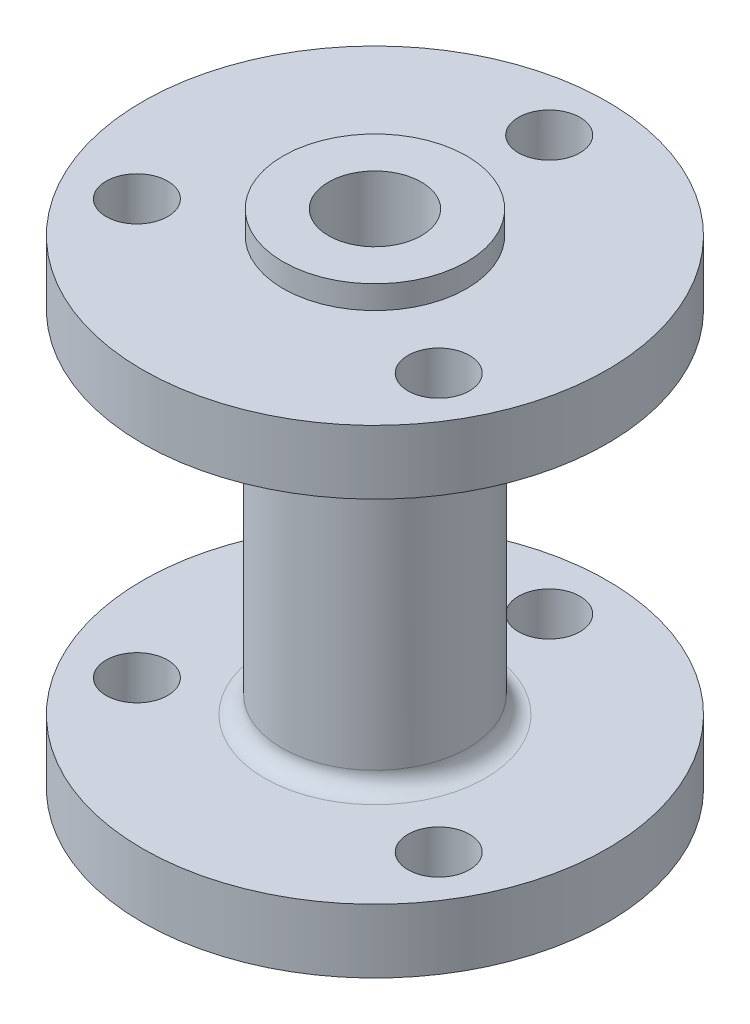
from build123d import *

# Parameters (mm, degrees)
F_8_0MM_DOWEL_HOLE1_D = 8
M5_CLEARANCE_HOLE1_D  = 5.3
CIRPATTERN1_COUNT     = 3
FILLET1_R             = 1.5


with BuildPart() as part:
    # Sketch2 → Revolve1 (revolve)
    with BuildSketch(Plane(origin=(0, 0, 0), x_dir=(0, 0, -1), z_dir=(1, 0, 0))):
        Polygon((0, 22.6), (-7.9, 22.6), (-7.9, 20.6), (-20, 20.6), (-20, 15.1), (-8, 15.1), (-8, -15.1), (-20, -15.1), (-20, -20.6), (-7.9, -20.6), (-7.9, -22.6), (0, -22.6), align=None)
    revolve(axis=Axis((0, 50, 0), (0, -1, 0)))

    # 8.0mm Dowel Hole1 (through all)
    with Locations(Plane(origin=(0, 22.6, 0), x_dir=(1, 0, 0), z_dir=(0, 1, 0))):
        with Locations((0, 0)):
            Hole(F_8_0MM_DOWEL_HOLE1_D / 2)

    # M5 Clearance Hole1 (through all)
    with Locations(Plane(origin=(0, 20.6, 0), x_dir=(1, 0, 0), z_dir=(0, 1, 0))):
        with Locations((0, 15)):
            m5_clearance_hole1 = Hole(M5_CLEARANCE_HOLE1_D / 2)

    # CirPattern1: M5 Clearance Hole1 ×3 about axis
    cirpattern1_axis = Axis((0, 0, 0), (0, 1, 0))
    for i in range(1, CIRPATTERN1_COUNT):
        add(m5_clearance_hole1.rotate(cirpattern1_axis, i * 360 / CIRPATTERN1_COUNT), mode=Mode.SUBTRACT)

    # Fillet1
    fillet1_edges = [part.edges().sort_by_distance(p)[0] for p in [
        (0, -15.1, -8),
        (0, 15.1, -8),
    ]]
    fillet(fillet1_edges, radius=FILLET1_R)


solid = part.part
